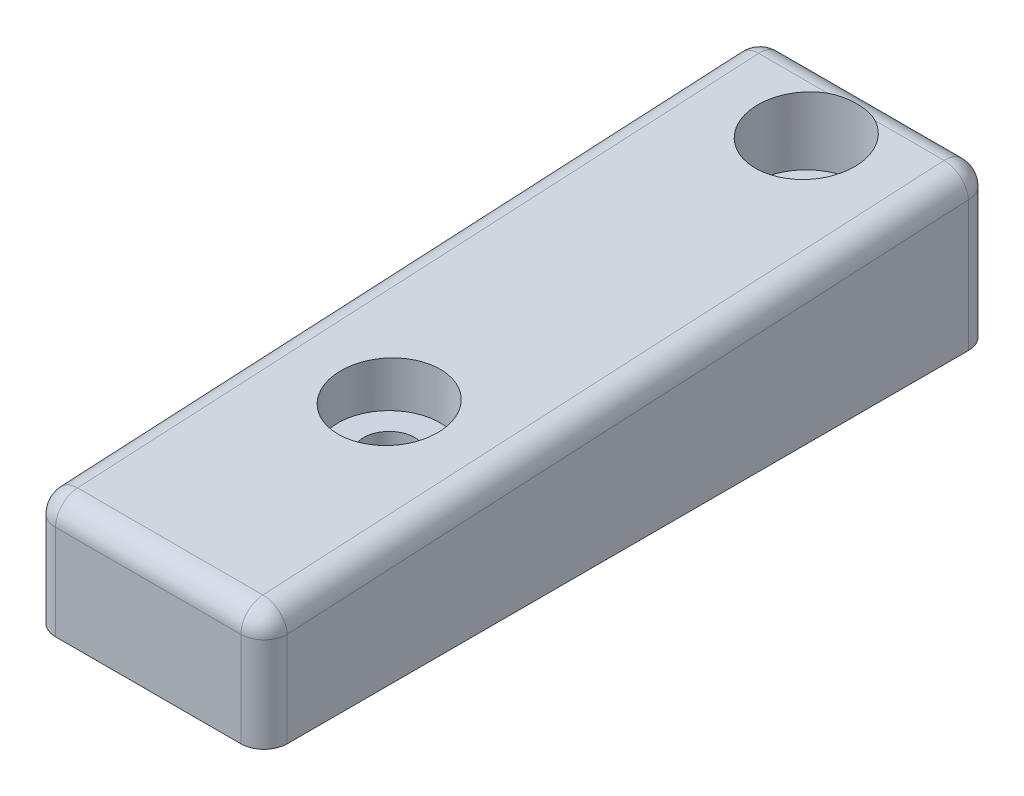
ISO-10303-21;
HEADER;
FILE_DESCRIPTION(('STEP AP214'),'2;1');
FILE_NAME('part.step','',(''),(''),'','','');
FILE_SCHEMA(('AUTOMOTIVE_DESIGN { 1 0 10303 214 1 1 1 1 }'));
ENDSEC;
DATA;
#1=APPLICATION_CONTEXT('core data for automotive mechanical design processes');
#2=APPLICATION_PROTOCOL_DEFINITION('international standard','automotive_design',2000,#1);
#3=PRODUCT_CONTEXT('',#1,'mechanical');
#4=PRODUCT('Part','Part','',(#3));
#5=PRODUCT_RELATED_PRODUCT_CATEGORY('part','',(#4));
#6=PRODUCT_DEFINITION_FORMATION('','',#4);
#7=PRODUCT_DEFINITION_CONTEXT('part definition',#1,'design');
#8=PRODUCT_DEFINITION('design','',#6,#7);
#9=PRODUCT_DEFINITION_SHAPE('','',#8);
#10=(LENGTH_UNIT() NAMED_UNIT(*) SI_UNIT(.MILLI.,.METRE.));
#11=(NAMED_UNIT(*) PLANE_ANGLE_UNIT() SI_UNIT($,.RADIAN.));
#12=(NAMED_UNIT(*) SI_UNIT($,.STERADIAN.) SOLID_ANGLE_UNIT());
#13=UNCERTAINTY_MEASURE_WITH_UNIT(LENGTH_MEASURE(1.E-05),#10,'distance_accuracy_value','');
#14=(GEOMETRIC_REPRESENTATION_CONTEXT(3) GLOBAL_UNCERTAINTY_ASSIGNED_CONTEXT((#13)) GLOBAL_UNIT_ASSIGNED_CONTEXT((#10,
#11,#12)) REPRESENTATION_CONTEXT('',''));
#15=CARTESIAN_POINT('',(0.,0.,0.));
#16=DIRECTION('',(0.,0.,1.));
#17=DIRECTION('',(1.,0.,0.));
#18=AXIS2_PLACEMENT_3D('',#15,#16,#17);
#19=CARTESIAN_POINT('',(50.,25.21,0.));
#20=DIRECTION('',(0.,-0.998629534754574,-0.0523359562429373));
#21=DIRECTION('',(0.,0.0523359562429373,-0.998629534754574));
#22=AXIS2_PLACEMENT_3D('',#19,#20,#21);
#23=PLANE('',#22);
#24=CARTESIAN_POINT('',(25.,32.6519046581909,-142.));
#25=DIRECTION('',(0.,-0.998629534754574,-0.0523359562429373));
#26=DIRECTION('',(0.,-0.0523359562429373,0.998629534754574));
#27=AXIS2_PLACEMENT_3D('',#24,#25,#26);
#28=ELLIPSE('',#27,11.0150958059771,11.);
#29=CARTESIAN_POINT('',(19.8848148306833,33.1622683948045,-151.738320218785));
#30=VERTEX_POINT('',#29);
#31=CARTESIAN_POINT('',(30.1151851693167,33.1622683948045,-151.738320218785));
#32=VERTEX_POINT('',#31);
#33=EDGE_CURVE('E50',#30,#32,#28,.F.);
#34=ORIENTED_EDGE('',*,*,#33,.F.);
#35=DIRECTION('',(-1.,0.,0.));
#36=VECTOR('',#35,1.);
#37=CARTESIAN_POINT('',(50.,33.1622683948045,-151.738320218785));
#38=LINE('',#37,#36);
#39=CARTESIAN_POINT('',(5.,33.1622683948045,-151.738320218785));
#40=VERTEX_POINT('',#39);
#41=EDGE_CURVE('E123',#30,#40,#38,.T.);
#42=ORIENTED_EDGE('',*,*,#41,.T.);
#43=DIRECTION('',(0.,-0.0523359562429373,0.998629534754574));
#44=VECTOR('',#43,1.);
#45=CARTESIAN_POINT('',(5.,25.4583248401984,-4.73832021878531));
#46=LINE('',#45,#44);
#47=CARTESIAN_POINT('',(5.,25.4583248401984,-4.73832021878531));
#48=VERTEX_POINT('',#47);
#49=EDGE_CURVE('E44',#40,#48,#46,.T.);
#50=ORIENTED_EDGE('',*,*,#49,.T.);
#51=DIRECTION('',(-1.,0.,0.));
#52=VECTOR('',#51,1.);
#53=CARTESIAN_POINT('',(50.,25.4583248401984,-4.73832021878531));
#54=LINE('',#53,#52);
#55=CARTESIAN_POINT('',(45.,25.4583248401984,-4.73832021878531));
#56=VERTEX_POINT('',#55);
#57=EDGE_CURVE('E134',#48,#56,#54,.F.);
#58=ORIENTED_EDGE('',*,*,#57,.T.);
#59=DIRECTION('',(0.,-0.0523359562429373,0.998629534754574));
#60=VECTOR('',#59,1.);
#61=CARTESIAN_POINT('',(45.,25.21,0.));
#62=LINE('',#61,#60);
#63=CARTESIAN_POINT('',(45.,33.1622683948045,-151.738320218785));
#64=VERTEX_POINT('',#63);
#65=EDGE_CURVE('E182',#56,#64,#62,.F.);
#66=ORIENTED_EDGE('',*,*,#65,.T.);
#67=EDGE_CURVE('E125',#64,#32,#38,.T.);
#68=ORIENTED_EDGE('',*,*,#67,.T.);
#69=EDGE_LOOP('',(#34,#42,#50,#58,#66,#68));
#70=FACE_BOUND('',#69,.T.);
#71=CARTESIAN_POINT('',(25.,27.9352045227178,-52.));
#72=DIRECTION('',(0.,-0.998629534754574,-0.0523359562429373));
#73=DIRECTION('',(0.,-0.0523359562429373,0.998629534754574));
#74=AXIS2_PLACEMENT_3D('',#71,#72,#73);
#75=ELLIPSE('',#74,11.0150958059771,11.);
#76=CARTESIAN_POINT('',(25.,27.3587189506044,-41.));
#77=VERTEX_POINT('',#76);
#78=EDGE_CURVE('E39',#77,#77,#75,.F.);
#79=ORIENTED_EDGE('',*,*,#78,.F.);
#80=EDGE_LOOP('',(#79));
#81=FACE_BOUND('',#80,.T.);
#82=ADVANCED_FACE('F35',(#70,#81),#23,.F.);
#83=CARTESIAN_POINT('',(50.,28.1691207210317,-152.));
#84=DIRECTION('',(-1.,0.,0.));
#85=DIRECTION('',(0.,0.,1.));
#86=AXIS2_PLACEMENT_3D('',#83,#84,#85);
#87=CYLINDRICAL_SURFACE('',#86,5.);
#88=ORIENTED_EDGE('',*,*,#41,.F.);
#89=CARTESIAN_POINT('',(34.7979589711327,28.1691207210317,-147.));
#90=CARTESIAN_POINT('',(34.7979589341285,28.043485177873,-146.999999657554));
#91=CARTESIAN_POINT('',(34.7955446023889,27.9178546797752,-147.004739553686));
#92=CARTESIAN_POINT('',(34.7858617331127,27.6674495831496,-147.023646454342));
#93=CARTESIAN_POINT('',(34.7785916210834,27.5426752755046,-147.037816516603));
#94=CARTESIAN_POINT('',(34.7591154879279,27.2947844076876,-147.075442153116));
#95=CARTESIAN_POINT('',(34.7469040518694,27.1716698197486,-147.09890791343));
#96=CARTESIAN_POINT('',(34.7174309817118,26.9280743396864,-147.154855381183));
#97=CARTESIAN_POINT('',(34.7001674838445,26.8075944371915,-147.187340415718));
#98=CARTESIAN_POINT('',(34.6604780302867,26.5703101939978,-147.260884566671));
#99=CARTESIAN_POINT('',(34.6380580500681,26.4535017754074,-147.301933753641));
#100=CARTESIAN_POINT('',(34.5878855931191,26.2241891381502,-147.392134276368));
#101=CARTESIAN_POINT('',(34.5601311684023,26.1116865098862,-147.441288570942));
#102=CARTESIAN_POINT('',(34.4991743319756,25.8918836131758,-147.547017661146));
#103=CARTESIAN_POINT('',(34.4659764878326,25.7845790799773,-147.603586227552));
#104=CARTESIAN_POINT('',(34.3939794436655,25.5757171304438,-147.723463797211));
#105=CARTESIAN_POINT('',(34.3551781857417,25.4741618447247,-147.786775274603));
#106=CARTESIAN_POINT('',(34.2716773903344,25.2769051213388,-147.919643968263));
#107=CARTESIAN_POINT('',(34.2269475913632,25.1812376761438,-147.989232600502));
#108=CARTESIAN_POINT('',(34.1317032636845,24.9967928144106,-148.133470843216));
#109=CARTESIAN_POINT('',(34.0811866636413,24.9080178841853,-148.208122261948));
#110=CARTESIAN_POINT('',(33.9744300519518,24.7377596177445,-148.361472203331));
#111=CARTESIAN_POINT('',(33.9181915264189,24.6562743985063,-148.440169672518));
#112=CARTESIAN_POINT('',(33.8000633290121,24.500737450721,-148.600667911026));
#113=CARTESIAN_POINT('',(33.7381715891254,24.4266884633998,-148.682469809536));
#114=CARTESIAN_POINT('',(33.6053505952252,24.2822214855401,-148.85275355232));
#115=CARTESIAN_POINT('',(33.5341109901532,24.2122299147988,-148.941354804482));
#116=CARTESIAN_POINT('',(33.3857859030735,24.080481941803,-149.119836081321));
#117=CARTESIAN_POINT('',(33.3086981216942,24.0187288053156,-149.209716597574));
#118=CARTESIAN_POINT('',(33.1490172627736,23.9032227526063,-149.389721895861));
#119=CARTESIAN_POINT('',(33.0664239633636,23.8494701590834,-149.4798466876));
#120=CARTESIAN_POINT('',(32.8960828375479,23.7495730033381,-149.659452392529));
#121=CARTESIAN_POINT('',(32.8083338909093,23.7034301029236,-149.748933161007));
#122=CARTESIAN_POINT('',(32.5842635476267,23.5976014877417,-149.969580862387));
#123=CARTESIAN_POINT('',(32.4450468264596,23.5422198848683,-150.099890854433));
#124=CARTESIAN_POINT('',(32.1572679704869,23.4453994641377,-150.355272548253));
#125=CARTESIAN_POINT('',(32.0087021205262,23.4039662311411,-150.480342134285));
#126=CARTESIAN_POINT('',(31.7030723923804,23.3330279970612,-150.723937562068));
#127=CARTESIAN_POINT('',(31.5459909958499,23.3035487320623,-150.842448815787));
#128=CARTESIAN_POINT('',(31.2246731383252,23.2546897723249,-151.071516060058));
#129=CARTESIAN_POINT('',(31.0604365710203,23.2353102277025,-151.182071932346));
#130=CARTESIAN_POINT('',(30.6567858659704,23.1984763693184,-151.438167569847));
#131=CARTESIAN_POINT('',(30.4142459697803,23.1850956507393,-151.579383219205));
#132=CARTESIAN_POINT('',(29.918775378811,23.1698422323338,-151.842992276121));
#133=CARTESIAN_POINT('',(29.6658404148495,23.1679743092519,-151.965377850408));
#134=CARTESIAN_POINT('',(29.1512206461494,23.1714821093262,-152.190500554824));
#135=CARTESIAN_POINT('',(28.8895294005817,23.1768632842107,-152.293222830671));
#136=CARTESIAN_POINT('',(28.3591873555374,23.1911848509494,-152.478298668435));
#137=CARTESIAN_POINT('',(28.0905373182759,23.2001248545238,-152.560654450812));
#138=CARTESIAN_POINT('',(27.5400344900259,23.2187398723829,-152.706614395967));
#139=CARTESIAN_POINT('',(27.2580233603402,23.2284285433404,-152.769620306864));
#140=CARTESIAN_POINT('',(26.6898485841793,23.2456889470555,-152.873260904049));
#141=CARTESIAN_POINT('',(26.4036848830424,23.2532606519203,-152.913895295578));
#142=CARTESIAN_POINT('',(25.8291773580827,23.264516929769,-152.972500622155));
#143=CARTESIAN_POINT('',(25.5408353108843,23.2682043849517,-152.990488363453));
#144=CARTESIAN_POINT('',(24.963608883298,23.270899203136,-153.003727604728));
#145=CARTESIAN_POINT('',(24.6747245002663,23.2699065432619,-152.998978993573));
#146=CARTESIAN_POINT('',(24.080988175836,23.2632546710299,-152.965812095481));
#147=CARTESIAN_POINT('',(23.7762169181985,23.2573193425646,-152.935992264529));
#148=CARTESIAN_POINT('',(23.1702791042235,23.241897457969,-152.851070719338));
#149=CARTESIAN_POINT('',(22.8691130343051,23.232410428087,-152.795965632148));
#150=CARTESIAN_POINT('',(22.2721558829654,23.2125081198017,-152.660798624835));
#151=CARTESIAN_POINT('',(21.9763704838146,23.2020919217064,-152.580711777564));
#152=CARTESIAN_POINT('',(21.392466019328,23.1839743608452,-152.396124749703));
#153=CARTESIAN_POINT('',(21.1043453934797,23.1762724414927,-152.291629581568));
#154=CARTESIAN_POINT('',(20.5933845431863,23.1689165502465,-152.081782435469));
#155=CARTESIAN_POINT('',(20.3688330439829,23.1679794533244,-151.980626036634));
#156=CARTESIAN_POINT('',(19.9270572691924,23.1735362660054,-151.763493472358));
#157=CARTESIAN_POINT('',(19.7098330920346,23.1800302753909,-151.647517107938));
#158=CARTESIAN_POINT('',(19.2844771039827,23.2035078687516,-151.401755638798));
#159=CARTESIAN_POINT('',(19.0763278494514,23.2204702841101,-151.271998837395));
#160=CARTESIAN_POINT('',(18.6702595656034,23.2682599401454,-150.99966994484));
#161=CARTESIAN_POINT('',(18.4723363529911,23.2990814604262,-150.857103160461));
#162=CARTESIAN_POINT('',(18.1470470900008,23.3661561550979,-150.606130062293));
#163=CARTESIAN_POINT('',(18.0165571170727,23.3978931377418,-150.50055045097));
#164=CARTESIAN_POINT('',(17.7621206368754,23.4710728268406,-150.284978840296));
#165=CARTESIAN_POINT('',(17.6381724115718,23.5125129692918,-150.174988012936));
#166=CARTESIAN_POINT('',(17.3976650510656,23.6062729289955,-149.951816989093));
#167=CARTESIAN_POINT('',(17.2810993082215,23.6585828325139,-149.838639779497));
#168=CARTESIAN_POINT('',(17.0560286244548,23.7752083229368,-149.610452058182));
#169=CARTESIAN_POINT('',(16.9475223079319,23.8395218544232,-149.495441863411));
#170=CARTESIAN_POINT('',(16.7571024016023,23.9689637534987,-149.284999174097));
#171=CARTESIAN_POINT('',(16.673810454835,24.0320805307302,-149.189574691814));
#172=CARTESIAN_POINT('',(16.5136950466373,24.1675296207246,-148.99985900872));
#173=CARTESIAN_POINT('',(16.4368702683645,24.2398600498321,-148.905567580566));
#174=CARTESIAN_POINT('',(16.2900182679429,24.3939083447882,-148.719395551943));
#175=CARTESIAN_POINT('',(16.2199902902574,24.4756251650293,-148.627514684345));
#176=CARTESIAN_POINT('',(16.0869686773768,24.6484127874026,-148.447511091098));
#177=CARTESIAN_POINT('',(16.0239751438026,24.7394837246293,-148.359388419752));
#178=CARTESIAN_POINT('',(15.9048605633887,24.931206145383,-148.187843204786));
#179=CARTESIAN_POINT('',(15.8487770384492,25.0319050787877,-148.104447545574));
#180=CARTESIAN_POINT('',(15.7439052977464,25.2419742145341,-147.94423107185));
#181=CARTESIAN_POINT('',(15.6951172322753,25.3513445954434,-147.867410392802));
#182=CARTESIAN_POINT('',(15.6047759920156,25.5780275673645,-147.721636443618));
#183=CARTESIAN_POINT('',(15.5632225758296,25.6953398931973,-147.652682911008));
#184=CARTESIAN_POINT('',(15.487204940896,25.9370017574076,-147.523796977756));
#185=CARTESIAN_POINT('',(15.4527401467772,26.0613507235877,-147.463863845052));
#186=CARTESIAN_POINT('',(15.3935749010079,26.3042296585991,-147.359092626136));
#187=CARTESIAN_POINT('',(15.3682656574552,26.4222314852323,-147.313370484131));
#188=CARTESIAN_POINT('',(15.323145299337,26.6623560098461,-147.230745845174));
#189=CARTESIAN_POINT('',(15.3033360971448,26.7844801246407,-147.193846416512));
#190=CARTESIAN_POINT('',(15.2690827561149,27.0318305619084,-147.129384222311));
#191=CARTESIAN_POINT('',(15.2546357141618,27.1570551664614,-147.101816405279));
#192=CARTESIAN_POINT('',(15.2309568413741,27.4097793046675,-147.056328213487));
#193=CARTESIAN_POINT('',(15.2217269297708,27.5372796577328,-147.038411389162));
#194=CARTESIAN_POINT('',(15.208581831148,27.7900470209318,-147.012816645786));
#195=CARTESIAN_POINT('',(15.204528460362,27.915280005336,-147.004872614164));
#196=CARTESIAN_POINT('',(15.2012377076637,28.1660981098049,-146.99842686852));
#197=CARTESIAN_POINT('',(15.2020020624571,28.2916833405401,-146.999928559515));
#198=CARTESIAN_POINT('',(15.2083570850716,28.5422083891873,-147.012362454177));
#199=CARTESIAN_POINT('',(15.213945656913,28.6671484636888,-147.023290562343));
#200=CARTESIAN_POINT('',(15.2300033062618,28.9155930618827,-147.054450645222));
#201=CARTESIAN_POINT('',(15.2404741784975,29.0390970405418,-147.074686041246));
#202=CARTESIAN_POINT('',(15.2663628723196,29.2834612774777,-147.124166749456));
#203=CARTESIAN_POINT('',(15.2817693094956,29.4043269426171,-147.153391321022));
#204=CARTESIAN_POINT('',(15.3176690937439,29.6428954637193,-147.220528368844));
#205=CARTESIAN_POINT('',(15.3381642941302,29.7605971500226,-147.258444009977));
#206=CARTESIAN_POINT('',(15.3843731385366,29.9919136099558,-147.34247278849));
#207=CARTESIAN_POINT('',(15.4100842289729,30.1055303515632,-147.388581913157));
#208=CARTESIAN_POINT('',(15.4668875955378,30.3280045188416,-147.488448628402));
#209=CARTESIAN_POINT('',(15.4979818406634,30.43686018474,-147.542209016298));
#210=CARTESIAN_POINT('',(15.5657998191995,30.649433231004,-147.65688179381));
#211=CARTESIAN_POINT('',(15.6025425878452,30.753131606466,-147.71781819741));
#212=CARTESIAN_POINT('',(15.6816734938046,30.9543781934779,-147.845893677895));
#213=CARTESIAN_POINT('',(15.7240636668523,31.0519241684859,-147.913034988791));
#214=CARTESIAN_POINT('',(15.85978434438,31.3344194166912,-148.122418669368));
#215=CARTESIAN_POINT('',(15.9617343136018,31.5094467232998,-148.272742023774));
#216=CARTESIAN_POINT('',(16.1919357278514,31.8353644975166,-148.592270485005));
#217=CARTESIAN_POINT('',(16.3209588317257,31.9852407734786,-148.761941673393));
#218=CARTESIAN_POINT('',(16.6015996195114,32.2533847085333,-149.107484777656));
#219=CARTESIAN_POINT('',(16.753226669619,32.3716392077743,-149.283359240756));
#220=CARTESIAN_POINT('',(17.0272216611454,32.5469748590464,-149.580398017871));
#221=CARTESIAN_POINT('',(17.1444464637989,32.6117198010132,-149.701919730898));
#222=CARTESIAN_POINT('',(17.38772839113,32.7281052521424,-149.942452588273));
#223=CARTESIAN_POINT('',(17.5137883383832,32.7797415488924,-150.06146291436));
#224=CARTESIAN_POINT('',(17.77397034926,32.8712985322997,-150.29549143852));
#225=CARTESIAN_POINT('',(17.9081050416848,32.9112002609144,-150.410502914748));
#226=CARTESIAN_POINT('',(18.1834021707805,32.9806663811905,-150.635136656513));
#227=CARTESIAN_POINT('',(18.3245666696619,33.0102277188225,-150.744757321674));
#228=CARTESIAN_POINT('',(18.6724558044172,33.0708298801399,-151.001452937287));
#229=CARTESIAN_POINT('',(18.8822682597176,33.0974799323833,-151.145392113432));
#230=CARTESIAN_POINT('',(19.3123148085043,33.1371588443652,-151.418878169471));
#231=CARTESIAN_POINT('',(19.5325533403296,33.1501818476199,-151.548418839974));
#232=CARTESIAN_POINT('',(19.9820464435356,33.1662913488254,-151.79211844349));
#233=CARTESIAN_POINT('',(20.2113118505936,33.1693655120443,-151.906258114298));
#234=CARTESIAN_POINT('',(20.6771887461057,33.1688459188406,-152.118241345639));
#235=CARTESIAN_POINT('',(20.9137995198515,33.1652528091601,-152.216086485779));
#236=CARTESIAN_POINT('',(21.402590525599,33.1540839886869,-152.398525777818));
#237=CARTESIAN_POINT('',(21.6550173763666,33.1463575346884,-152.482449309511));
#238=CARTESIAN_POINT('',(22.1652440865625,33.1296142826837,-152.631783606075));
#239=CARTESIAN_POINT('',(22.4230440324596,33.120597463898,-152.697194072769));
#240=CARTESIAN_POINT('',(22.9424892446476,33.1035433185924,-152.809124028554));
#241=CARTESIAN_POINT('',(23.2041305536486,33.0955050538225,-152.855661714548));
#242=CARTESIAN_POINT('',(23.7301719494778,33.0820719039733,-152.929688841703));
#243=CARTESIAN_POINT('',(23.9945721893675,33.0766771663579,-152.95717722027));
#244=CARTESIAN_POINT('',(24.5673930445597,33.0690022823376,-152.99581515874));
#245=CARTESIAN_POINT('',(24.876053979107,33.0673626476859,-153.003625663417));
#246=CARTESIAN_POINT('',(25.4929443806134,33.0694689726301,-152.993279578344));
#247=CARTESIAN_POINT('',(25.8011737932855,33.0732155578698,-152.975119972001));
#248=CARTESIAN_POINT('',(26.4155038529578,33.0851735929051,-152.912921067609));
#249=CARTESIAN_POINT('',(26.7215994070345,33.0933934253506,-152.868833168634));
#250=CARTESIAN_POINT('',(27.3289090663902,33.1121132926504,-152.755074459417));
#251=CARTESIAN_POINT('',(27.6301233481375,33.122613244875,-152.68540457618));
#252=CARTESIAN_POINT('',(28.2237977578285,33.1425335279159,-152.52147193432));
#253=CARTESIAN_POINT('',(28.5163007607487,33.1519601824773,-152.427365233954));
#254=CARTESIAN_POINT('',(29.0926098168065,33.165632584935,-152.214933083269));
#255=CARTESIAN_POINT('',(29.3764139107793,33.1698771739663,-152.096602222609));
#256=CARTESIAN_POINT('',(29.9324535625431,33.168143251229,-151.836911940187));
#257=CARTESIAN_POINT('',(30.2047156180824,33.1621896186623,-151.695609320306));
#258=CARTESIAN_POINT('',(30.735813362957,33.1342651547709,-151.391161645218));
#259=CARTESIAN_POINT('',(30.9946591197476,33.112306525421,-151.228033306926));
#260=CARTESIAN_POINT('',(31.3924046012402,33.0595157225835,-150.953725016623));
#261=CARTESIAN_POINT('',(31.5367105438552,33.0360881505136,-150.848897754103));
#262=CARTESIAN_POINT('',(31.8189236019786,32.9799961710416,-150.633294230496));
#263=CARTESIAN_POINT('',(31.9568326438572,32.9473345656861,-150.522519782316));
#264=CARTESIAN_POINT('',(32.2253018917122,32.8713618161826,-150.296132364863));
#265=CARTESIAN_POINT('',(32.3558706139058,32.8280633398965,-150.18052528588));
#266=CARTESIAN_POINT('',(32.6089434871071,32.7293796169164,-149.945675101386));
#267=CARTESIAN_POINT('',(32.7314490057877,32.6739964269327,-149.826432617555));
#268=CARTESIAN_POINT('',(32.9464422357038,32.5609365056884,-149.607446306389));
#269=CARTESIAN_POINT('',(33.0403889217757,32.5054272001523,-149.508014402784));
#270=CARTESIAN_POINT('',(33.2217171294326,32.384811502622,-149.308999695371));
#271=CARTESIAN_POINT('',(33.3091001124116,32.3197072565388,-149.209416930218));
#272=CARTESIAN_POINT('',(33.4768519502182,32.1794848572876,-149.011406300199));
#273=CARTESIAN_POINT('',(33.557221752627,32.1043680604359,-148.912978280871));
#274=CARTESIAN_POINT('',(33.7105797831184,31.9439093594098,-148.71871384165));
#275=CARTESIAN_POINT('',(33.783567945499,31.8585673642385,-148.62287744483));
#276=CARTESIAN_POINT('',(33.9223437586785,31.6771015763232,-148.434713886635));
#277=CARTESIAN_POINT('',(33.9880798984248,31.5809093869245,-148.342414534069));
#278=CARTESIAN_POINT('',(34.1116238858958,31.3785385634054,-148.163612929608));
#279=CARTESIAN_POINT('',(34.1694314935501,31.2723596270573,-148.077110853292));
#280=CARTESIAN_POINT('',(34.2770919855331,31.0506093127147,-147.911457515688));
#281=CARTESIAN_POINT('',(34.3269436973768,30.9350365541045,-147.832307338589));
#282=CARTESIAN_POINT('',(34.4187657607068,30.6953781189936,-147.682829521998));
#283=CARTESIAN_POINT('',(34.4607371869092,30.5712936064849,-147.612500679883));
#284=CARTESIAN_POINT('',(34.5325272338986,30.3306241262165,-147.489570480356));
#285=CARTESIAN_POINT('',(34.5631927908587,30.2148566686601,-147.435857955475));
#286=CARTESIAN_POINT('',(34.6186849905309,29.9783541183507,-147.337050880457));
#287=CARTESIAN_POINT('',(34.6435120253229,29.857619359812,-147.291955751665));
#288=CARTESIAN_POINT('',(34.6874643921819,29.6122829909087,-147.211060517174));
#289=CARTESIAN_POINT('',(34.7065985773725,29.4876877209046,-147.17524599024));
#290=CARTESIAN_POINT('',(34.7393711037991,29.2354522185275,-147.113304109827));
#291=CARTESIAN_POINT('',(34.7530113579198,29.107813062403,-147.087173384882));
#292=CARTESIAN_POINT('',(34.7753440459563,28.8456305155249,-147.044131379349));
#293=CARTESIAN_POINT('',(34.7838329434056,28.7110071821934,-147.027600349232));
#294=CARTESIAN_POINT('',(34.7951403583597,28.4406274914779,-147.005534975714));
#295=CARTESIAN_POINT('',(34.7979590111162,28.3048711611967,-147.000000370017));
#296=CARTESIAN_POINT('',(34.7979589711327,28.1691207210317,-147.));
#297=B_SPLINE_CURVE_WITH_KNOTS('',3,(#89,#90,#91,#92,#93,#94,#95,#96,#97,#98,#99,#100,#101,#102,
#103,#104,#105,#106,#107,#108,#109,#110,#111,#112,#113,#114,#115,#116,#117,#118,#119,#120,#121,
#122,#123,#124,#125,#126,#127,#128,#129,#130,#131,#132,#133,#134,#135,#136,#137,#138,#139,#140,
#141,#142,#143,#144,#145,#146,#147,#148,#149,#150,#151,#152,#153,#154,#155,#156,#157,#158,#159,
#160,#161,#162,#163,#164,#165,#166,#167,#168,#169,#170,#171,#172,#173,#174,#175,#176,#177,#178,
#179,#180,#181,#182,#183,#184,#185,#186,#187,#188,#189,#190,#191,#192,#193,#194,#195,#196,#197,
#198,#199,#200,#201,#202,#203,#204,#205,#206,#207,#208,#209,#210,#211,#212,#213,#214,#215,#216,
#217,#218,#219,#220,#221,#222,#223,#224,#225,#226,#227,#228,#229,#230,#231,#232,#233,#234,#235,
#236,#237,#238,#239,#240,#241,#242,#243,#244,#245,#246,#247,#248,#249,#250,#251,#252,#253,#254,
#255,#256,#257,#258,#259,#260,#261,#262,#263,#264,#265,#266,#267,#268,#269,#270,#271,#272,#273,
#274,#275,#276,#277,#278,#279,#280,#281,#282,#283,#284,#285,#286,#287,#288,#289,#290,#291,#292,
#293,#294,#295,#296),.UNSPECIFIED.,.T.,.F.,(4,2,2,2,2,2,2,2,2,2,2,2,2,2,2,2,2,2,2,2,2,2,2,2,2,2,
2,2,2,2,2,2,2,2,2,2,2,2,2,2,2,2,2,2,2,2,2,2,2,2,2,2,2,2,2,2,2,2,2,2,2,2,2,2,2,2,2,2,2,2,2,2,2,2,
2,2,2,2,2,2,2,2,2,2,2,2,2,2,2,2,2,2,2,2,2,2,2,2,2,2,2,2,2,4),(0.,0.376785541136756,
0.753693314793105,1.13101524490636,1.50847654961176,1.88550262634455,2.26266664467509,
2.63951578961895,3.01650368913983,3.39549584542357,3.77462408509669,4.1536541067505,
4.53282334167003,4.93293423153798,5.3332032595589,5.73348842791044,6.13386089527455,
6.728649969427,7.32367691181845,7.91997819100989,8.51628833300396,9.35797278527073,
10.2000064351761,11.0426736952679,11.8852490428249,12.7517276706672,13.6182177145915,
14.4840643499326,15.3499152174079,16.26765935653,17.1855259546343,18.1043113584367,
19.0229082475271,19.7611669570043,20.4994355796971,21.236216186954,21.972692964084,
22.4847764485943,22.996724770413,23.5082082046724,24.0196041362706,24.4437385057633,
24.8677863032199,25.2917869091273,25.715793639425,26.1420098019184,26.5682347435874,
26.9944454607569,27.4206215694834,27.8073159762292,28.1941446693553,28.5807636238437,
28.9675247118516,29.343729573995,29.7200700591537,30.0962471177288,30.4725625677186,
30.8480161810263,31.2236067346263,31.5990138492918,31.9745585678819,32.3513977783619,
32.7283731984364,33.4815499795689,34.2601507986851,35.0390751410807,35.5808955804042,
36.122889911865,36.6657551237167,37.2087805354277,37.9751156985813,38.7417800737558,
39.5093946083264,40.2769346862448,41.0745927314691,41.8722636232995,42.6691635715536,
43.4661079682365,44.3912331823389,45.3164658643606,46.2434383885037,47.1703773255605,
48.091536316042,49.012901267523,49.93202169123,50.8504421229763,51.3897465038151,
51.928887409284,52.4673893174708,53.0057996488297,53.4482650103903,53.8906315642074,
54.3329382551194,54.7752488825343,55.2205225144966,55.6658096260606,56.1111623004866,
56.5564541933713,56.949722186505,57.3429637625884,57.7355905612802,58.1280805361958,
58.5352107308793,58.9423312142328),.UNSPECIFIED.);
#298=EDGE_CURVE('E11',#30,#32,#297,.T.);
#299=ORIENTED_EDGE('',*,*,#298,.T.);
#300=ORIENTED_EDGE('',*,*,#67,.F.);
#301=CARTESIAN_POINT('',(45.,28.1691207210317,-152.));
#302=DIRECTION('',(-1.,0.,0.));
#303=DIRECTION('',(0.,0.,1.));
#304=AXIS2_PLACEMENT_3D('',#301,#302,#303);
#305=CIRCLE('',#304,5.);
#306=CARTESIAN_POINT('',(45.,28.1691207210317,-157.));
#307=VERTEX_POINT('',#306);
#308=EDGE_CURVE('E166',#64,#307,#305,.T.);
#309=ORIENTED_EDGE('',*,*,#308,.T.);
#310=DIRECTION('',(-1.,0.,0.));
#311=VECTOR('',#310,1.);
#312=CARTESIAN_POINT('',(50.,28.1691207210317,-157.));
#313=LINE('',#312,#311);
#314=CARTESIAN_POINT('',(5.,28.1691207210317,-157.));
#315=VERTEX_POINT('',#314);
#316=EDGE_CURVE('E136',#315,#307,#313,.F.);
#317=ORIENTED_EDGE('',*,*,#316,.F.);
#318=CARTESIAN_POINT('',(5.,28.1691207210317,-152.));
#319=DIRECTION('',(-1.,0.,0.));
#320=DIRECTION('',(0.,0.,1.));
#321=AXIS2_PLACEMENT_3D('',#318,#319,#320);
#322=CIRCLE('',#321,5.);
#323=EDGE_CURVE('E132',#315,#40,#322,.F.);
#324=ORIENTED_EDGE('',*,*,#323,.T.);
#325=EDGE_LOOP('',(#88,#299,#300,#309,#317,#324));
#326=FACE_BOUND('',#325,.T.);
#327=ADVANCED_FACE('F129',(#326),#87,.T.);
#328=CARTESIAN_POINT('',(50.,0.,-157.));
#329=DIRECTION('',(0.,1.,0.));
#330=DIRECTION('',(0.,0.,1.));
#331=AXIS2_PLACEMENT_3D('',#328,#329,#330);
#332=PLANE('',#331);
#333=CARTESIAN_POINT('',(25.,0.,-142.));
#334=DIRECTION('',(0.,1.,0.));
#335=DIRECTION('',(0.,0.,1.));
#336=AXIS2_PLACEMENT_3D('',#333,#334,#335);
#337=CIRCLE('',#336,5.5);
#338=CARTESIAN_POINT('',(25.,0.,-136.5));
#339=VERTEX_POINT('',#338);
#340=EDGE_CURVE('E247',#339,#339,#337,.T.);
#341=ORIENTED_EDGE('',*,*,#340,.T.);
#342=EDGE_LOOP('',(#341));
#343=FACE_BOUND('',#342,.T.);
#344=CARTESIAN_POINT('',(25.,0.,-52.));
#345=DIRECTION('',(0.,1.,0.));
#346=DIRECTION('',(0.,0.,1.));
#347=AXIS2_PLACEMENT_3D('',#344,#345,#346);
#348=CIRCLE('',#347,5.5);
#349=CARTESIAN_POINT('',(25.,0.,-46.5));
#350=VERTEX_POINT('',#349);
#351=EDGE_CURVE('E251',#350,#350,#348,.T.);
#352=ORIENTED_EDGE('',*,*,#351,.T.);
#353=EDGE_LOOP('',(#352));
#354=FACE_BOUND('',#353,.T.);
#355=DIRECTION('',(0.,0.,-1.));
#356=VECTOR('',#355,1.);
#357=CARTESIAN_POINT('',(0.,0.,-157.));
#358=LINE('',#357,#356);
#359=CARTESIAN_POINT('',(0.,0.,-5.));
#360=VERTEX_POINT('',#359);
#361=CARTESIAN_POINT('',(0.,0.,-152.));
#362=VERTEX_POINT('',#361);
#363=EDGE_CURVE('E197',#360,#362,#358,.T.);
#364=ORIENTED_EDGE('',*,*,#363,.T.);
#365=CARTESIAN_POINT('',(5.,0.,-152.));
#366=DIRECTION('',(0.,1.,0.));
#367=DIRECTION('',(0.,0.,1.));
#368=AXIS2_PLACEMENT_3D('',#365,#366,#367);
#369=CIRCLE('',#368,5.);
#370=CARTESIAN_POINT('',(5.,0.,-157.));
#371=VERTEX_POINT('',#370);
#372=EDGE_CURVE('E164',#362,#371,#369,.F.);
#373=ORIENTED_EDGE('',*,*,#372,.T.);
#374=DIRECTION('',(-1.,0.,0.));
#375=VECTOR('',#374,1.);
#376=CARTESIAN_POINT('',(50.,0.,-157.));
#377=LINE('',#376,#375);
#378=CARTESIAN_POINT('',(45.,0.,-157.));
#379=VERTEX_POINT('',#378);
#380=EDGE_CURVE('E138',#379,#371,#377,.T.);
#381=ORIENTED_EDGE('',*,*,#380,.F.);
#382=CARTESIAN_POINT('',(45.,0.,-152.));
#383=DIRECTION('',(0.,1.,0.));
#384=DIRECTION('',(0.,0.,1.));
#385=AXIS2_PLACEMENT_3D('',#382,#383,#384);
#386=CIRCLE('',#385,5.);
#387=CARTESIAN_POINT('',(50.,0.,-152.));
#388=VERTEX_POINT('',#387);
#389=EDGE_CURVE('E160',#379,#388,#386,.F.);
#390=ORIENTED_EDGE('',*,*,#389,.T.);
#391=DIRECTION('',(0.,0.,-1.));
#392=VECTOR('',#391,1.);
#393=CARTESIAN_POINT('',(50.,0.,-157.));
#394=LINE('',#393,#392);
#395=CARTESIAN_POINT('',(50.,0.,-5.));
#396=VERTEX_POINT('',#395);
#397=EDGE_CURVE('E260',#396,#388,#394,.T.);
#398=ORIENTED_EDGE('',*,*,#397,.F.);
#399=CARTESIAN_POINT('',(45.,0.,-5.));
#400=DIRECTION('',(0.,1.,0.));
#401=DIRECTION('',(0.,0.,1.));
#402=AXIS2_PLACEMENT_3D('',#399,#400,#401);
#403=CIRCLE('',#402,5.);
#404=CARTESIAN_POINT('',(45.,0.,0.));
#405=VERTEX_POINT('',#404);
#406=EDGE_CURVE('E158',#396,#405,#403,.F.);
#407=ORIENTED_EDGE('',*,*,#406,.T.);
#408=DIRECTION('',(-1.,0.,0.));
#409=VECTOR('',#408,1.);
#410=CARTESIAN_POINT('',(50.,0.,0.));
#411=LINE('',#410,#409);
#412=CARTESIAN_POINT('',(5.,0.,0.));
#413=VERTEX_POINT('',#412);
#414=EDGE_CURVE('E278',#405,#413,#411,.T.);
#415=ORIENTED_EDGE('',*,*,#414,.T.);
#416=CARTESIAN_POINT('',(5.,0.,-5.));
#417=DIRECTION('',(0.,1.,0.));
#418=DIRECTION('',(0.,0.,1.));
#419=AXIS2_PLACEMENT_3D('',#416,#417,#418);
#420=CIRCLE('',#419,5.);
#421=EDGE_CURVE('E162',#413,#360,#420,.F.);
#422=ORIENTED_EDGE('',*,*,#421,.T.);
#423=EDGE_LOOP('',(#364,#373,#381,#390,#398,#407,#415,#422));
#424=FACE_BOUND('',#423,.T.);
#425=ADVANCED_FACE('F237',(#343,#354,#424),#332,.F.);
#426=CARTESIAN_POINT('',(50.,33.4380213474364,-157.));
#427=DIRECTION('',(0.,0.,1.));
#428=DIRECTION('',(1.,0.,0.));
#429=AXIS2_PLACEMENT_3D('',#426,#427,#428);
#430=PLANE('',#429);
#431=ORIENTED_EDGE('',*,*,#380,.T.);
#432=DIRECTION('',(0.,1.,0.));
#433=VECTOR('',#432,1.);
#434=CARTESIAN_POINT('',(5.,28.1691207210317,-157.));
#435=LINE('',#434,#433);
#436=EDGE_CURVE('E149',#371,#315,#435,.T.);
#437=ORIENTED_EDGE('',*,*,#436,.T.);
#438=ORIENTED_EDGE('',*,*,#316,.T.);
#439=DIRECTION('',(0.,1.,0.));
#440=VECTOR('',#439,1.);
#441=CARTESIAN_POINT('',(45.,33.4380213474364,-157.));
#442=LINE('',#441,#440);
#443=EDGE_CURVE('E147',#307,#379,#442,.F.);
#444=ORIENTED_EDGE('',*,*,#443,.T.);
#445=EDGE_LOOP('',(#431,#437,#438,#444));
#446=FACE_BOUND('',#445,.T.);
#447=ADVANCED_FACE('F232',(#446),#430,.F.);
#448=CARTESIAN_POINT('',(50.,0.,0.));
#449=DIRECTION('',(0.,0.,-1.));
#450=DIRECTION('',(-1.,0.,0.));
#451=AXIS2_PLACEMENT_3D('',#448,#449,#450);
#452=PLANE('',#451);
#453=DIRECTION('',(-1.,0.,0.));
#454=VECTOR('',#453,1.);
#455=CARTESIAN_POINT('',(50.,20.4651771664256,0.));
#456=LINE('',#455,#454);
#457=CARTESIAN_POINT('',(45.,20.4651771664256,0.));
#458=VERTEX_POINT('',#457);
#459=CARTESIAN_POINT('',(5.,20.4651771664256,0.));
#460=VERTEX_POINT('',#459);
#461=EDGE_CURVE('E144',#458,#460,#456,.T.);
#462=ORIENTED_EDGE('',*,*,#461,.T.);
#463=DIRECTION('',(0.,-1.,0.));
#464=VECTOR('',#463,1.);
#465=CARTESIAN_POINT('',(5.,0.,0.));
#466=LINE('',#465,#464);
#467=EDGE_CURVE('E171',#460,#413,#466,.T.);
#468=ORIENTED_EDGE('',*,*,#467,.T.);
#469=ORIENTED_EDGE('',*,*,#414,.F.);
#470=DIRECTION('',(0.,-1.,0.));
#471=VECTOR('',#470,1.);
#472=CARTESIAN_POINT('',(45.,0.,0.));
#473=LINE('',#472,#471);
#474=EDGE_CURVE('E169',#405,#458,#473,.F.);
#475=ORIENTED_EDGE('',*,*,#474,.T.);
#476=EDGE_LOOP('',(#462,#468,#469,#475));
#477=FACE_BOUND('',#476,.T.);
#478=ADVANCED_FACE('F225',(#477),#452,.F.);
#479=CARTESIAN_POINT('',(50.,0.,0.));
#480=DIRECTION('',(-1.,0.,0.));
#481=DIRECTION('',(0.,0.,1.));
#482=AXIS2_PLACEMENT_3D('',#479,#480,#481);
#483=PLANE('',#482);
#484=ORIENTED_EDGE('',*,*,#397,.T.);
#485=DIRECTION('',(0.,1.,0.));
#486=VECTOR('',#485,1.);
#487=CARTESIAN_POINT('',(50.,0.,-152.));
#488=LINE('',#487,#486);
#489=CARTESIAN_POINT('',(50.,28.1691207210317,-152.));
#490=VERTEX_POINT('',#489);
#491=EDGE_CURVE('E180',#388,#490,#488,.T.);
#492=ORIENTED_EDGE('',*,*,#491,.T.);
#493=DIRECTION('',(0.,-0.0523359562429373,0.998629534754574));
#494=VECTOR('',#493,1.);
#495=CARTESIAN_POINT('',(50.,20.1478008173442,1.05590149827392));
#496=LINE('',#495,#494);
#497=CARTESIAN_POINT('',(50.,20.4651771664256,-5.));
#498=VERTEX_POINT('',#497);
#499=EDGE_CURVE('E57',#490,#498,#496,.T.);
#500=ORIENTED_EDGE('',*,*,#499,.T.);
#501=DIRECTION('',(0.,-1.,0.));
#502=VECTOR('',#501,1.);
#503=CARTESIAN_POINT('',(50.,0.,-5.));
#504=LINE('',#503,#502);
#505=EDGE_CURVE('E178',#498,#396,#504,.T.);
#506=ORIENTED_EDGE('',*,*,#505,.T.);
#507=EDGE_LOOP('',(#484,#492,#500,#506));
#508=FACE_BOUND('',#507,.T.);
#509=ADVANCED_FACE('F221',(#508),#483,.F.);
#510=CARTESIAN_POINT('',(0.,0.,0.));
#511=DIRECTION('',(-1.,0.,0.));
#512=DIRECTION('',(0.,0.,1.));
#513=AXIS2_PLACEMENT_3D('',#510,#511,#512);
#514=PLANE('',#513);
#515=DIRECTION('',(0.,-0.0523359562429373,0.998629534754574));
#516=VECTOR('',#515,1.);
#517=CARTESIAN_POINT('',(0.,28.1691207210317,-152.));
#518=LINE('',#517,#516);
#519=CARTESIAN_POINT('',(0.,20.4651771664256,-5.));
#520=VERTEX_POINT('',#519);
#521=CARTESIAN_POINT('',(0.,28.1691207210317,-152.));
#522=VERTEX_POINT('',#521);
#523=EDGE_CURVE('E152',#520,#522,#518,.F.);
#524=ORIENTED_EDGE('',*,*,#523,.T.);
#525=DIRECTION('',(0.,1.,0.));
#526=VECTOR('',#525,1.);
#527=CARTESIAN_POINT('',(0.,0.,-152.));
#528=LINE('',#527,#526);
#529=EDGE_CURVE('E156',#522,#362,#528,.F.);
#530=ORIENTED_EDGE('',*,*,#529,.T.);
#531=ORIENTED_EDGE('',*,*,#363,.F.);
#532=DIRECTION('',(0.,-1.,0.));
#533=VECTOR('',#532,1.);
#534=CARTESIAN_POINT('',(0.,20.4651771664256,-5.));
#535=LINE('',#534,#533);
#536=EDGE_CURVE('E154',#360,#520,#535,.F.);
#537=ORIENTED_EDGE('',*,*,#536,.T.);
#538=EDGE_LOOP('',(#524,#530,#531,#537));
#539=FACE_BOUND('',#538,.T.);
#540=ADVANCED_FACE('F224',(#539),#514,.T.);
#541=CARTESIAN_POINT('',(50.,20.4651771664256,-5.));
#542=DIRECTION('',(-1.,0.,0.));
#543=DIRECTION('',(0.,0.,1.));
#544=AXIS2_PLACEMENT_3D('',#541,#542,#543);
#545=CYLINDRICAL_SURFACE('',#544,5.);
#546=ORIENTED_EDGE('',*,*,#57,.F.);
#547=CARTESIAN_POINT('',(5.,20.4651771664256,-5.));
#548=DIRECTION('',(-1.,0.,0.));
#549=DIRECTION('',(0.,0.,1.));
#550=AXIS2_PLACEMENT_3D('',#547,#548,#549);
#551=CIRCLE('',#550,5.);
#552=EDGE_CURVE('E175',#48,#460,#551,.F.);
#553=ORIENTED_EDGE('',*,*,#552,.T.);
#554=ORIENTED_EDGE('',*,*,#461,.F.);
#555=CARTESIAN_POINT('',(45.,20.4651771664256,-5.));
#556=DIRECTION('',(-1.,0.,0.));
#557=DIRECTION('',(0.,0.,1.));
#558=AXIS2_PLACEMENT_3D('',#555,#556,#557);
#559=CIRCLE('',#558,5.);
#560=EDGE_CURVE('E173',#458,#56,#559,.T.);
#561=ORIENTED_EDGE('',*,*,#560,.T.);
#562=EDGE_LOOP('',(#546,#553,#554,#561));
#563=FACE_BOUND('',#562,.T.);
#564=ADVANCED_FACE('F228',(#563),#545,.T.);
#565=CARTESIAN_POINT('',(5.,0.,-5.));
#566=DIRECTION('',(0.,1.,0.));
#567=DIRECTION('',(0.,0.,1.));
#568=AXIS2_PLACEMENT_3D('',#565,#566,#567);
#569=CYLINDRICAL_SURFACE('',#568,5.);
#570=ORIENTED_EDGE('',*,*,#421,.F.);
#571=ORIENTED_EDGE('',*,*,#467,.F.);
#572=CARTESIAN_POINT('',(5.,20.4651771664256,-5.));
#573=DIRECTION('',(0.,1.,0.));
#574=DIRECTION('',(0.,0.,1.));
#575=AXIS2_PLACEMENT_3D('',#572,#573,#574);
#576=CIRCLE('',#575,5.);
#577=EDGE_CURVE('E194',#520,#460,#576,.T.);
#578=ORIENTED_EDGE('',*,*,#577,.F.);
#579=ORIENTED_EDGE('',*,*,#536,.F.);
#580=EDGE_LOOP('',(#570,#571,#578,#579));
#581=FACE_BOUND('',#580,.T.);
#582=ADVANCED_FACE('F446',(#581),#569,.T.);
#583=CARTESIAN_POINT('',(5.,20.4651771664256,-5.));
#584=DIRECTION('',(0.,0.,1.));
#585=DIRECTION('',(1.,0.,0.));
#586=AXIS2_PLACEMENT_3D('',#583,#584,#585);
#587=SPHERICAL_SURFACE('',#586,5.);
#588=ORIENTED_EDGE('',*,*,#577,.T.);
#589=ORIENTED_EDGE('',*,*,#552,.F.);
#590=CARTESIAN_POINT('',(5.,20.4651771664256,-5.));
#591=DIRECTION('',(0.,0.0523359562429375,-0.998629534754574));
#592=DIRECTION('',(0.,0.998629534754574,0.0523359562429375));
#593=AXIS2_PLACEMENT_3D('',#590,#591,#592);
#594=CIRCLE('',#593,5.);
#595=EDGE_CURVE('E191',#520,#48,#594,.T.);
#596=ORIENTED_EDGE('',*,*,#595,.F.);
#597=EDGE_LOOP('',(#588,#589,#596));
#598=FACE_BOUND('',#597,.T.);
#599=ADVANCED_FACE('F436',(#598),#587,.T.);
#600=CARTESIAN_POINT('',(5.,20.2168523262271,-0.261679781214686));
#601=DIRECTION('',(0.,0.0523359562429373,-0.998629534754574));
#602=DIRECTION('',(0.,0.998629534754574,0.0523359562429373));
#603=AXIS2_PLACEMENT_3D('',#600,#601,#602);
#604=CYLINDRICAL_SURFACE('',#603,5.);
#605=ORIENTED_EDGE('',*,*,#595,.T.);
#606=ORIENTED_EDGE('',*,*,#49,.F.);
#607=CARTESIAN_POINT('',(5.,28.1691207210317,-152.));
#608=DIRECTION('',(0.,0.0523359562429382,-0.998629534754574));
#609=DIRECTION('',(0.,0.998629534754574,0.0523359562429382));
#610=AXIS2_PLACEMENT_3D('',#607,#608,#609);
#611=CIRCLE('',#610,5.);
#612=EDGE_CURVE('E187',#522,#40,#611,.T.);
#613=ORIENTED_EDGE('',*,*,#612,.F.);
#614=ORIENTED_EDGE('',*,*,#523,.F.);
#615=EDGE_LOOP('',(#605,#606,#613,#614));
#616=FACE_BOUND('',#615,.T.);
#617=ADVANCED_FACE('F425',(#616),#604,.T.);
#618=CARTESIAN_POINT('',(5.,28.1691207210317,-152.));
#619=DIRECTION('',(0.,0.,1.));
#620=DIRECTION('',(1.,0.,0.));
#621=AXIS2_PLACEMENT_3D('',#618,#619,#620);
#622=SPHERICAL_SURFACE('',#621,5.);
#623=ORIENTED_EDGE('',*,*,#612,.T.);
#624=ORIENTED_EDGE('',*,*,#323,.F.);
#625=CARTESIAN_POINT('',(5.,28.1691207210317,-152.));
#626=DIRECTION('',(0.,-1.,0.));
#627=DIRECTION('',(0.,0.,-1.));
#628=AXIS2_PLACEMENT_3D('',#625,#626,#627);
#629=CIRCLE('',#628,5.);
#630=EDGE_CURVE('E185',#522,#315,#629,.T.);
#631=ORIENTED_EDGE('',*,*,#630,.F.);
#632=EDGE_LOOP('',(#623,#624,#631));
#633=FACE_BOUND('',#632,.T.);
#634=ADVANCED_FACE('F416',(#633),#622,.T.);
#635=CARTESIAN_POINT('',(5.,33.4380213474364,-152.));
#636=DIRECTION('',(0.,-1.,0.));
#637=DIRECTION('',(0.,0.,-1.));
#638=AXIS2_PLACEMENT_3D('',#635,#636,#637);
#639=CYLINDRICAL_SURFACE('',#638,5.);
#640=ORIENTED_EDGE('',*,*,#372,.F.);
#641=ORIENTED_EDGE('',*,*,#529,.F.);
#642=ORIENTED_EDGE('',*,*,#630,.T.);
#643=ORIENTED_EDGE('',*,*,#436,.F.);
#644=EDGE_LOOP('',(#640,#641,#642,#643));
#645=FACE_BOUND('',#644,.T.);
#646=ADVANCED_FACE('F265',(#645),#639,.T.);
#647=CARTESIAN_POINT('',(45.,0.,-5.));
#648=DIRECTION('',(0.,-1.,0.));
#649=DIRECTION('',(0.,0.,-1.));
#650=AXIS2_PLACEMENT_3D('',#647,#648,#649);
#651=CYLINDRICAL_SURFACE('',#650,5.);
#652=CARTESIAN_POINT('',(45.,20.4651771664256,-5.));
#653=DIRECTION('',(0.,1.,0.));
#654=DIRECTION('',(0.,0.,1.));
#655=AXIS2_PLACEMENT_3D('',#652,#653,#654);
#656=CIRCLE('',#655,5.);
#657=EDGE_CURVE('E188',#458,#498,#656,.T.);
#658=ORIENTED_EDGE('',*,*,#657,.F.);
#659=ORIENTED_EDGE('',*,*,#474,.F.);
#660=ORIENTED_EDGE('',*,*,#406,.F.);
#661=ORIENTED_EDGE('',*,*,#505,.F.);
#662=EDGE_LOOP('',(#658,#659,#660,#661));
#663=FACE_BOUND('',#662,.T.);
#664=ADVANCED_FACE('F37',(#663),#651,.T.);
#665=CARTESIAN_POINT('',(45.,20.4651771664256,-5.));
#666=DIRECTION('',(0.,0.,1.));
#667=DIRECTION('',(1.,0.,0.));
#668=AXIS2_PLACEMENT_3D('',#665,#666,#667);
#669=SPHERICAL_SURFACE('',#668,5.);
#670=ORIENTED_EDGE('',*,*,#560,.F.);
#671=ORIENTED_EDGE('',*,*,#657,.T.);
#672=CARTESIAN_POINT('',(45.,20.4651771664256,-5.));
#673=DIRECTION('',(0.,0.0523359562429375,-0.998629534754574));
#674=DIRECTION('',(0.,0.998629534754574,0.0523359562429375));
#675=AXIS2_PLACEMENT_3D('',#672,#673,#674);
#676=CIRCLE('',#675,5.);
#677=EDGE_CURVE('E202',#56,#498,#676,.T.);
#678=ORIENTED_EDGE('',*,*,#677,.F.);
#679=EDGE_LOOP('',(#670,#671,#678));
#680=FACE_BOUND('',#679,.T.);
#681=ADVANCED_FACE('F389',(#680),#669,.T.);
#682=CARTESIAN_POINT('',(45.,20.1478008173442,1.05590149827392));
#683=DIRECTION('',(0.,-0.0523359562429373,0.998629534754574));
#684=DIRECTION('',(0.,-0.998629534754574,-0.0523359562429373));
#685=AXIS2_PLACEMENT_3D('',#682,#683,#684);
#686=CYLINDRICAL_SURFACE('',#685,5.);
#687=CARTESIAN_POINT('',(45.,28.1691207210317,-152.));
#688=DIRECTION('',(0.,0.0523359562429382,-0.998629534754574));
#689=DIRECTION('',(0.,0.998629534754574,0.0523359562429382));
#690=AXIS2_PLACEMENT_3D('',#687,#688,#689);
#691=CIRCLE('',#690,5.);
#692=EDGE_CURVE('E199',#64,#490,#691,.T.);
#693=ORIENTED_EDGE('',*,*,#692,.F.);
#694=ORIENTED_EDGE('',*,*,#65,.F.);
#695=ORIENTED_EDGE('',*,*,#677,.T.);
#696=ORIENTED_EDGE('',*,*,#499,.F.);
#697=EDGE_LOOP('',(#693,#694,#695,#696));
#698=FACE_BOUND('',#697,.T.);
#699=ADVANCED_FACE('F379',(#698),#686,.T.);
#700=CARTESIAN_POINT('',(45.,28.1691207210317,-152.));
#701=DIRECTION('',(0.,0.,1.));
#702=DIRECTION('',(1.,0.,0.));
#703=AXIS2_PLACEMENT_3D('',#700,#701,#702);
#704=SPHERICAL_SURFACE('',#703,5.);
#705=ORIENTED_EDGE('',*,*,#308,.F.);
#706=ORIENTED_EDGE('',*,*,#692,.T.);
#707=CARTESIAN_POINT('',(45.,28.1691207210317,-152.));
#708=DIRECTION('',(0.,-1.,0.));
#709=DIRECTION('',(0.,0.,-1.));
#710=AXIS2_PLACEMENT_3D('',#707,#708,#709);
#711=CIRCLE('',#710,5.);
#712=EDGE_CURVE('E126',#307,#490,#711,.T.);
#713=ORIENTED_EDGE('',*,*,#712,.F.);
#714=EDGE_LOOP('',(#705,#706,#713));
#715=FACE_BOUND('',#714,.T.);
#716=ADVANCED_FACE('F272',(#715),#704,.T.);
#717=CARTESIAN_POINT('',(45.,0.,-152.));
#718=DIRECTION('',(0.,1.,0.));
#719=DIRECTION('',(0.,0.,1.));
#720=AXIS2_PLACEMENT_3D('',#717,#718,#719);
#721=CYLINDRICAL_SURFACE('',#720,5.);
#722=ORIENTED_EDGE('',*,*,#389,.F.);
#723=ORIENTED_EDGE('',*,*,#443,.F.);
#724=ORIENTED_EDGE('',*,*,#712,.T.);
#725=ORIENTED_EDGE('',*,*,#491,.F.);
#726=EDGE_LOOP('',(#722,#723,#724,#725));
#727=FACE_BOUND('',#726,.T.);
#728=ADVANCED_FACE('F218',(#727),#721,.T.);
#729=CARTESIAN_POINT('',(25.,61.5,-142.));
#730=DIRECTION('',(0.,-1.,0.));
#731=DIRECTION('',(0.,0.,-1.));
#732=AXIS2_PLACEMENT_3D('',#729,#730,#731);
#733=CYLINDRICAL_SURFACE('',#732,11.);
#734=CARTESIAN_POINT('',(25.,18.5,-142.));
#735=DIRECTION('',(0.,1.,0.));
#736=DIRECTION('',(0.,0.,1.));
#737=AXIS2_PLACEMENT_3D('',#734,#735,#736);
#738=CIRCLE('',#737,11.);
#739=CARTESIAN_POINT('',(25.,18.5,-131.));
#740=VERTEX_POINT('',#739);
#741=EDGE_CURVE('E127',#740,#740,#738,.T.);
#742=ORIENTED_EDGE('',*,*,#741,.F.);
#743=EDGE_LOOP('',(#742));
#744=FACE_BOUND('',#743,.T.);
#745=ORIENTED_EDGE('',*,*,#33,.T.);
#746=ORIENTED_EDGE('',*,*,#298,.F.);
#747=EDGE_LOOP('',(#745,#746));
#748=FACE_BOUND('',#747,.T.);
#749=ADVANCED_FACE('F116',(#744,#748),#733,.F.);
#750=CARTESIAN_POINT('',(25.,18.5,-142.));
#751=DIRECTION('',(0.,1.,0.));
#752=DIRECTION('',(0.,0.,1.));
#753=AXIS2_PLACEMENT_3D('',#750,#751,#752);
#754=PLANE('',#753);
#755=CARTESIAN_POINT('',(25.,18.5,-142.));
#756=DIRECTION('',(0.,1.,0.));
#757=DIRECTION('',(0.,0.,1.));
#758=AXIS2_PLACEMENT_3D('',#755,#756,#757);
#759=CIRCLE('',#758,5.5);
#760=CARTESIAN_POINT('',(25.,18.5,-136.5));
#761=VERTEX_POINT('',#760);
#762=EDGE_CURVE('E292',#761,#761,#759,.T.);
#763=ORIENTED_EDGE('',*,*,#762,.F.);
#764=EDGE_LOOP('',(#763));
#765=FACE_BOUND('',#764,.T.);
#766=ORIENTED_EDGE('',*,*,#741,.T.);
#767=EDGE_LOOP('',(#766));
#768=FACE_BOUND('',#767,.T.);
#769=ADVANCED_FACE('F217',(#765,#768),#754,.T.);
#770=CARTESIAN_POINT('',(25.,61.5,-52.));
#771=DIRECTION('',(0.,-1.,0.));
#772=DIRECTION('',(0.,0.,-1.));
#773=AXIS2_PLACEMENT_3D('',#770,#771,#772);
#774=CYLINDRICAL_SURFACE('',#773,11.);
#775=CARTESIAN_POINT('',(25.,18.5,-52.));
#776=DIRECTION('',(0.,1.,0.));
#777=DIRECTION('',(0.,0.,1.));
#778=AXIS2_PLACEMENT_3D('',#775,#776,#777);
#779=CIRCLE('',#778,11.);
#780=CARTESIAN_POINT('',(25.,18.5,-41.));
#781=VERTEX_POINT('',#780);
#782=EDGE_CURVE('E284',#781,#781,#779,.T.);
#783=ORIENTED_EDGE('',*,*,#782,.F.);
#784=EDGE_LOOP('',(#783));
#785=FACE_BOUND('',#784,.T.);
#786=ORIENTED_EDGE('',*,*,#78,.T.);
#787=EDGE_LOOP('',(#786));
#788=FACE_BOUND('',#787,.T.);
#789=ADVANCED_FACE('F301',(#785,#788),#774,.F.);
#790=CARTESIAN_POINT('',(25.,18.5,-52.));
#791=DIRECTION('',(0.,1.,0.));
#792=DIRECTION('',(0.,0.,1.));
#793=AXIS2_PLACEMENT_3D('',#790,#791,#792);
#794=PLANE('',#793);
#795=CARTESIAN_POINT('',(25.,18.5,-52.));
#796=DIRECTION('',(0.,1.,0.));
#797=DIRECTION('',(0.,0.,1.));
#798=AXIS2_PLACEMENT_3D('',#795,#796,#797);
#799=CIRCLE('',#798,5.5);
#800=CARTESIAN_POINT('',(25.,18.5,-46.5));
#801=VERTEX_POINT('',#800);
#802=EDGE_CURVE('E288',#801,#801,#799,.T.);
#803=ORIENTED_EDGE('',*,*,#802,.F.);
#804=EDGE_LOOP('',(#803));
#805=FACE_BOUND('',#804,.T.);
#806=ORIENTED_EDGE('',*,*,#782,.T.);
#807=EDGE_LOOP('',(#806));
#808=FACE_BOUND('',#807,.T.);
#809=ADVANCED_FACE('F306',(#805,#808),#794,.T.);
#810=CARTESIAN_POINT('',(25.,-24.5,-52.));
#811=DIRECTION('',(0.,1.,0.));
#812=DIRECTION('',(0.,0.,1.));
#813=AXIS2_PLACEMENT_3D('',#810,#811,#812);
#814=CYLINDRICAL_SURFACE('',#813,5.5);
#815=ORIENTED_EDGE('',*,*,#802,.T.);
#816=EDGE_LOOP('',(#815));
#817=FACE_BOUND('',#816,.T.);
#818=ORIENTED_EDGE('',*,*,#351,.F.);
#819=EDGE_LOOP('',(#818));
#820=FACE_BOUND('',#819,.T.);
#821=ADVANCED_FACE('F311',(#817,#820),#814,.F.);
#822=CARTESIAN_POINT('',(25.,-24.5,-142.));
#823=DIRECTION('',(0.,1.,0.));
#824=DIRECTION('',(0.,0.,1.));
#825=AXIS2_PLACEMENT_3D('',#822,#823,#824);
#826=CYLINDRICAL_SURFACE('',#825,5.5);
#827=ORIENTED_EDGE('',*,*,#762,.T.);
#828=EDGE_LOOP('',(#827));
#829=FACE_BOUND('',#828,.T.);
#830=ORIENTED_EDGE('',*,*,#340,.F.);
#831=EDGE_LOOP('',(#830));
#832=FACE_BOUND('',#831,.T.);
#833=ADVANCED_FACE('F296',(#829,#832),#826,.F.);
#834=CLOSED_SHELL('',(#82,#327,#425,#447,#478,#509,#540,#564,#582,#599,#617,#634,#646,#664,#681,
#699,#716,#728,#749,#769,#789,#809,#821,#833));
#835=MANIFOLD_SOLID_BREP('B2',#834);
#836=ADVANCED_BREP_SHAPE_REPRESENTATION('',(#18,#835),#14);
#837=SHAPE_DEFINITION_REPRESENTATION(#9,#836);
ENDSEC;
END-ISO-10303-21;
